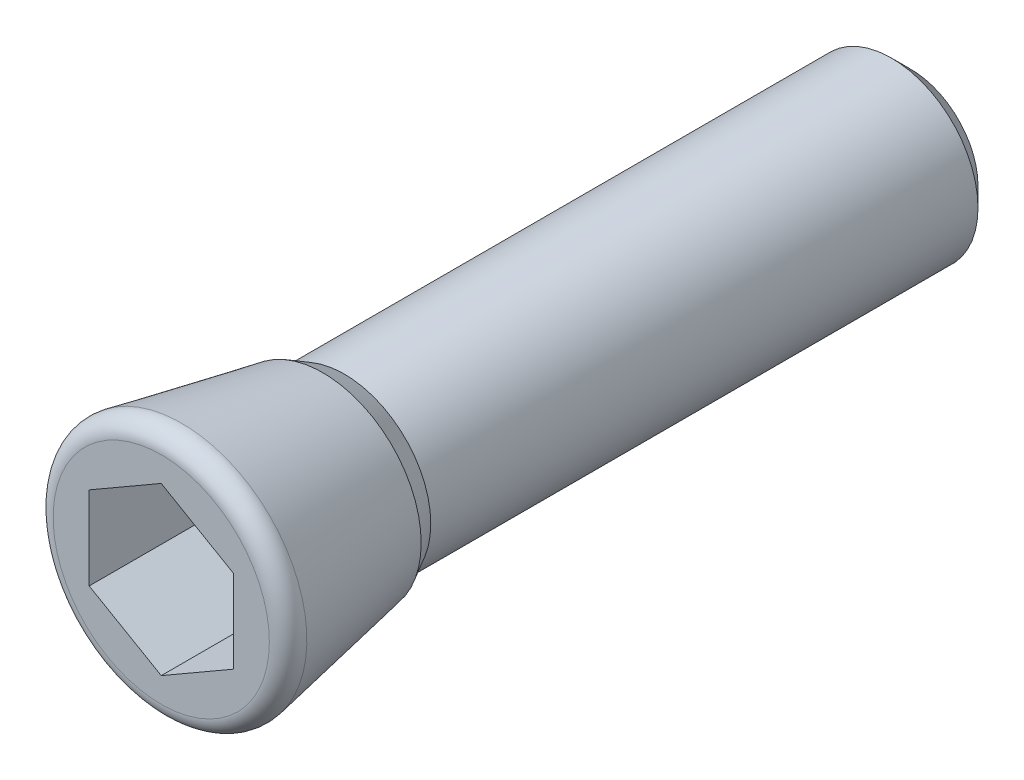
ISO-10303-21;
HEADER;
FILE_DESCRIPTION(('STEP AP214'),'2;1');
FILE_NAME('part.step','',(''),(''),'','','');
FILE_SCHEMA(('AUTOMOTIVE_DESIGN { 1 0 10303 214 1 1 1 1 }'));
ENDSEC;
DATA;
#1=APPLICATION_CONTEXT('core data for automotive mechanical design processes');
#2=APPLICATION_PROTOCOL_DEFINITION('international standard','automotive_design',2000,#1);
#3=PRODUCT_CONTEXT('',#1,'mechanical');
#4=PRODUCT('Part','Part','',(#3));
#5=PRODUCT_RELATED_PRODUCT_CATEGORY('part','',(#4));
#6=PRODUCT_DEFINITION_FORMATION('','',#4);
#7=PRODUCT_DEFINITION_CONTEXT('part definition',#1,'design');
#8=PRODUCT_DEFINITION('design','',#6,#7);
#9=PRODUCT_DEFINITION_SHAPE('','',#8);
#10=(LENGTH_UNIT() NAMED_UNIT(*) SI_UNIT(.MILLI.,.METRE.));
#11=(NAMED_UNIT(*) PLANE_ANGLE_UNIT() SI_UNIT($,.RADIAN.));
#12=(NAMED_UNIT(*) SI_UNIT($,.STERADIAN.) SOLID_ANGLE_UNIT());
#13=UNCERTAINTY_MEASURE_WITH_UNIT(LENGTH_MEASURE(1.E-05),#10,'distance_accuracy_value','');
#14=(GEOMETRIC_REPRESENTATION_CONTEXT(3) GLOBAL_UNCERTAINTY_ASSIGNED_CONTEXT((#13)) GLOBAL_UNIT_ASSIGNED_CONTEXT((#10,
#11,#12)) REPRESENTATION_CONTEXT('',''));
#15=CARTESIAN_POINT('',(0.,0.,0.));
#16=DIRECTION('',(0.,0.,1.));
#17=DIRECTION('',(1.,0.,0.));
#18=AXIS2_PLACEMENT_3D('',#15,#16,#17);
#19=CARTESIAN_POINT('',(-4.0419021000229,2.33359326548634,-52.));
#20=DIRECTION('',(0.,0.,-1.));
#21=DIRECTION('',(-0.5,-0.866025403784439,0.));
#22=AXIS2_PLACEMENT_3D('',#19,#20,#21);
#23=PLANE('',#22);
#24=CARTESIAN_POINT('',(0.,0.,-52.));
#25=DIRECTION('',(0.,0.,-1.));
#26=DIRECTION('',(-0.5,-0.866025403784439,0.));
#27=AXIS2_PLACEMENT_3D('',#24,#25,#26);
#28=CIRCLE('',#27,4.66718653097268);
#29=CARTESIAN_POINT('',(-2.33359326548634,-4.04190210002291,-52.));
#30=VERTEX_POINT('',#29);
#31=EDGE_CURVE('E9',#30,#30,#28,.T.);
#32=ORIENTED_EDGE('',*,*,#31,.T.);
#33=EDGE_LOOP('',(#32));
#34=FACE_BOUND('',#33,.T.);
#35=ADVANCED_FACE('F14',(#34),#23,.T.);
#36=CARTESIAN_POINT('',(0.,0.,-52.));
#37=DIRECTION('',(0.,0.,1.));
#38=DIRECTION('',(0.5,0.866025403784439,0.));
#39=AXIS2_PLACEMENT_3D('',#36,#37,#38);
#40=CONICAL_SURFACE('',#39,4.66718653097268,0.785398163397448);
#41=CARTESIAN_POINT('',(0.,0.,-50.6671865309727));
#42=DIRECTION('',(0.,0.,-1.));
#43=DIRECTION('',(-0.5,-0.866025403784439,0.));
#44=AXIS2_PLACEMENT_3D('',#41,#42,#43);
#45=CIRCLE('',#44,6.);
#46=CARTESIAN_POINT('',(-3.,-5.19615242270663,-50.6671865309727));
#47=VERTEX_POINT('',#46);
#48=EDGE_CURVE('E21',#47,#47,#45,.T.);
#49=ORIENTED_EDGE('',*,*,#48,.T.);
#50=EDGE_LOOP('',(#49));
#51=FACE_BOUND('',#50,.T.);
#52=ORIENTED_EDGE('',*,*,#31,.F.);
#53=EDGE_LOOP('',(#52));
#54=FACE_BOUND('',#53,.T.);
#55=ADVANCED_FACE('F136',(#51,#54),#40,.T.);
#56=CARTESIAN_POINT('',(0.,0.,-72.0161004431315));
#57=DIRECTION('',(0.,0.,-1.));
#58=DIRECTION('',(-0.5,-0.866025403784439,0.));
#59=AXIS2_PLACEMENT_3D('',#56,#57,#58);
#60=CYLINDRICAL_SURFACE('',#59,6.);
#61=CARTESIAN_POINT('',(0.,0.,-12.7));
#62=DIRECTION('',(0.,0.,-1.));
#63=DIRECTION('',(-0.5,-0.866025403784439,0.));
#64=AXIS2_PLACEMENT_3D('',#61,#62,#63);
#65=CIRCLE('',#64,6.);
#66=CARTESIAN_POINT('',(-3.,-5.19615242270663,-12.7));
#67=VERTEX_POINT('',#66);
#68=EDGE_CURVE('E131',#67,#67,#65,.T.);
#69=ORIENTED_EDGE('',*,*,#68,.T.);
#70=EDGE_LOOP('',(#69));
#71=FACE_BOUND('',#70,.T.);
#72=ORIENTED_EDGE('',*,*,#48,.F.);
#73=EDGE_LOOP('',(#72));
#74=FACE_BOUND('',#73,.T.);
#75=ADVANCED_FACE('F139',(#71,#74),#60,.T.);
#76=CARTESIAN_POINT('',(0.,0.,-12.7));
#77=DIRECTION('',(0.,0.,1.));
#78=DIRECTION('',(0.5,0.866025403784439,0.));
#79=AXIS2_PLACEMENT_3D('',#76,#77,#78);
#80=CONICAL_SURFACE('',#79,6.,0.505024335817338);
#81=CARTESIAN_POINT('',(0.,0.,-11.2136100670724));
#82=DIRECTION('',(0.,0.,-1.));
#83=DIRECTION('',(-0.5,-0.866025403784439,0.));
#84=AXIS2_PLACEMENT_3D('',#81,#82,#83);
#85=CIRCLE('',#84,6.82174224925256);
#86=CARTESIAN_POINT('',(-3.41087112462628,-5.90780208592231,-11.2136100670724));
#87=VERTEX_POINT('',#86);
#88=EDGE_CURVE('E128',#87,#87,#85,.T.);
#89=ORIENTED_EDGE('',*,*,#88,.T.);
#90=EDGE_LOOP('',(#89));
#91=FACE_BOUND('',#90,.T.);
#92=ORIENTED_EDGE('',*,*,#68,.F.);
#93=EDGE_LOOP('',(#92));
#94=FACE_BOUND('',#93,.T.);
#95=ADVANCED_FACE('F141',(#91,#94),#80,.T.);
#96=CARTESIAN_POINT('',(0.,0.,-11.2136100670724));
#97=DIRECTION('',(0.,0.,1.));
#98=DIRECTION('',(0.5,0.866025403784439,0.));
#99=AXIS2_PLACEMENT_3D('',#96,#97,#98);
#100=CONICAL_SURFACE('',#99,6.82174224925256,0.187479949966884);
#101=CARTESIAN_POINT('',(0.,0.,-1.4236603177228));
#102=DIRECTION('',(0.,0.,-1.));
#103=DIRECTION('',(-0.5,-0.866025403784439,0.));
#104=AXIS2_PLACEMENT_3D('',#101,#102,#103);
#105=CIRCLE('',#104,8.67897246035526);
#106=CARTESIAN_POINT('',(-4.33948623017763,-7.51621062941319,-1.4236603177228));
#107=VERTEX_POINT('',#106);
#108=EDGE_CURVE('E125',#107,#107,#105,.T.);
#109=ORIENTED_EDGE('',*,*,#108,.T.);
#110=EDGE_LOOP('',(#109));
#111=FACE_BOUND('',#110,.T.);
#112=ORIENTED_EDGE('',*,*,#88,.F.);
#113=EDGE_LOOP('',(#112));
#114=FACE_BOUND('',#113,.T.);
#115=ADVANCED_FACE('F150',(#111,#114),#100,.T.);
#116=CARTESIAN_POINT('',(0.,0.,-1.2));
#117=DIRECTION('',(0.,0.,-1.));
#118=DIRECTION('',(-0.5,-0.866025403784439,0.));
#119=AXIS2_PLACEMENT_3D('',#116,#117,#118);
#120=TOROIDAL_SURFACE('',#119,7.5,1.2);
#121=CARTESIAN_POINT('',(0.,0.,0.));
#122=DIRECTION('',(0.,0.,-1.));
#123=DIRECTION('',(-0.5,-0.866025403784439,0.));
#124=AXIS2_PLACEMENT_3D('',#121,#122,#123);
#125=CIRCLE('',#124,7.5);
#126=CARTESIAN_POINT('',(-3.75,-6.49519052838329,0.));
#127=VERTEX_POINT('',#126);
#128=EDGE_CURVE('E116',#127,#127,#125,.T.);
#129=ORIENTED_EDGE('',*,*,#128,.T.);
#130=EDGE_LOOP('',(#129));
#131=FACE_BOUND('',#130,.T.);
#132=ORIENTED_EDGE('',*,*,#108,.F.);
#133=EDGE_LOOP('',(#132));
#134=FACE_BOUND('',#133,.T.);
#135=ADVANCED_FACE('F189',(#131,#134),#120,.T.);
#136=CARTESIAN_POINT('',(0.,0.,0.));
#137=DIRECTION('',(0.,0.,1.));
#138=DIRECTION('',(0.5,0.866025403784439,0.));
#139=AXIS2_PLACEMENT_3D('',#136,#137,#138);
#140=PLANE('',#139);
#141=DIRECTION('',(0.866025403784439,0.5,0.));
#142=VECTOR('',#141,1.);
#143=CARTESIAN_POINT('',(0.,-5.77350269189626,0.));
#144=LINE('',#143,#142);
#145=CARTESIAN_POINT('',(0.,-5.77350269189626,0.));
#146=VERTEX_POINT('',#145);
#147=CARTESIAN_POINT('',(5.,-2.88675134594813,0.));
#148=VERTEX_POINT('',#147);
#149=EDGE_CURVE('E28',#146,#148,#144,.T.);
#150=ORIENTED_EDGE('',*,*,#149,.F.);
#151=DIRECTION('',(0.866025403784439,-0.5,0.));
#152=VECTOR('',#151,1.);
#153=CARTESIAN_POINT('',(-5.,-2.88675134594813,0.));
#154=LINE('',#153,#152);
#155=CARTESIAN_POINT('',(-5.,-2.88675134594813,0.));
#156=VERTEX_POINT('',#155);
#157=EDGE_CURVE('E98',#156,#146,#154,.T.);
#158=ORIENTED_EDGE('',*,*,#157,.F.);
#159=DIRECTION('',(0.,-1.,0.));
#160=VECTOR('',#159,1.);
#161=CARTESIAN_POINT('',(-5.,2.88675134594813,0.));
#162=LINE('',#161,#160);
#163=CARTESIAN_POINT('',(-5.,2.88675134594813,0.));
#164=VERTEX_POINT('',#163);
#165=EDGE_CURVE('E92',#164,#156,#162,.T.);
#166=ORIENTED_EDGE('',*,*,#165,.F.);
#167=DIRECTION('',(-0.866025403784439,-0.5,0.));
#168=VECTOR('',#167,1.);
#169=CARTESIAN_POINT('',(0.,5.77350269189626,0.));
#170=LINE('',#169,#168);
#171=CARTESIAN_POINT('',(0.,5.77350269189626,0.));
#172=VERTEX_POINT('',#171);
#173=EDGE_CURVE('E90',#172,#164,#170,.T.);
#174=ORIENTED_EDGE('',*,*,#173,.F.);
#175=DIRECTION('',(-0.866025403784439,0.5,0.));
#176=VECTOR('',#175,1.);
#177=CARTESIAN_POINT('',(5.,2.88675134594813,0.));
#178=LINE('',#177,#176);
#179=CARTESIAN_POINT('',(5.,2.88675134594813,0.));
#180=VERTEX_POINT('',#179);
#181=EDGE_CURVE('E71',#180,#172,#178,.T.);
#182=ORIENTED_EDGE('',*,*,#181,.F.);
#183=DIRECTION('',(0.,1.,0.));
#184=VECTOR('',#183,1.);
#185=CARTESIAN_POINT('',(5.,-2.88675134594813,0.));
#186=LINE('',#185,#184);
#187=EDGE_CURVE('E82',#148,#180,#186,.T.);
#188=ORIENTED_EDGE('',*,*,#187,.F.);
#189=EDGE_LOOP('',(#150,#158,#166,#174,#182,#188));
#190=FACE_BOUND('',#189,.T.);
#191=ORIENTED_EDGE('',*,*,#128,.F.);
#192=EDGE_LOOP('',(#191));
#193=FACE_BOUND('',#192,.T.);
#194=ADVANCED_FACE('F86',(#190,#193),#140,.T.);
#195=CARTESIAN_POINT('',(0.,-5.77350269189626,-7.5));
#196=DIRECTION('',(0.5,-0.866025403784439,0.));
#197=DIRECTION('',(0.866025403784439,0.5,0.));
#198=AXIS2_PLACEMENT_3D('',#195,#196,#197);
#199=PLANE('',#198);
#200=ORIENTED_EDGE('',*,*,#149,.T.);
#201=DIRECTION('',(0.,0.,1.));
#202=VECTOR('',#201,1.);
#203=CARTESIAN_POINT('',(5.,-2.88675134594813,-7.5));
#204=LINE('',#203,#202);
#205=CARTESIAN_POINT('',(5.,-2.88675134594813,-7.5));
#206=VERTEX_POINT('',#205);
#207=EDGE_CURVE('E79',#206,#148,#204,.T.);
#208=ORIENTED_EDGE('',*,*,#207,.F.);
#209=DIRECTION('',(0.866025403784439,0.5,0.));
#210=VECTOR('',#209,1.);
#211=CARTESIAN_POINT('',(0.,-5.77350269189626,-7.5));
#212=LINE('',#211,#210);
#213=CARTESIAN_POINT('',(0.,-5.77350269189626,-7.5));
#214=VERTEX_POINT('',#213);
#215=EDGE_CURVE('E100',#214,#206,#212,.T.);
#216=ORIENTED_EDGE('',*,*,#215,.F.);
#217=DIRECTION('',(0.,0.,1.));
#218=VECTOR('',#217,1.);
#219=CARTESIAN_POINT('',(0.,-5.77350269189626,-7.5));
#220=LINE('',#219,#218);
#221=EDGE_CURVE('E35',#214,#146,#220,.T.);
#222=ORIENTED_EDGE('',*,*,#221,.T.);
#223=EDGE_LOOP('',(#200,#208,#216,#222));
#224=FACE_BOUND('',#223,.T.);
#225=ADVANCED_FACE('F205',(#224),#199,.F.);
#226=CARTESIAN_POINT('',(-5.,-2.88675134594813,-7.5));
#227=DIRECTION('',(-0.5,-0.866025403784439,0.));
#228=DIRECTION('',(0.866025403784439,-0.5,0.));
#229=AXIS2_PLACEMENT_3D('',#226,#227,#228);
#230=PLANE('',#229);
#231=ORIENTED_EDGE('',*,*,#157,.T.);
#232=ORIENTED_EDGE('',*,*,#221,.F.);
#233=DIRECTION('',(0.866025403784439,-0.5,0.));
#234=VECTOR('',#233,1.);
#235=CARTESIAN_POINT('',(-5.,-2.88675134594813,-7.5));
#236=LINE('',#235,#234);
#237=CARTESIAN_POINT('',(-5.,-2.88675134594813,-7.5));
#238=VERTEX_POINT('',#237);
#239=EDGE_CURVE('E112',#238,#214,#236,.T.);
#240=ORIENTED_EDGE('',*,*,#239,.F.);
#241=DIRECTION('',(0.,0.,1.));
#242=VECTOR('',#241,1.);
#243=CARTESIAN_POINT('',(-5.,-2.88675134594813,-7.5));
#244=LINE('',#243,#242);
#245=EDGE_CURVE('E117',#238,#156,#244,.T.);
#246=ORIENTED_EDGE('',*,*,#245,.T.);
#247=EDGE_LOOP('',(#231,#232,#240,#246));
#248=FACE_BOUND('',#247,.T.);
#249=ADVANCED_FACE('F213',(#248),#230,.F.);
#250=CARTESIAN_POINT('',(-5.,2.88675134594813,-7.5));
#251=DIRECTION('',(-1.,0.,0.));
#252=DIRECTION('',(0.,-1.,0.));
#253=AXIS2_PLACEMENT_3D('',#250,#251,#252);
#254=PLANE('',#253);
#255=ORIENTED_EDGE('',*,*,#165,.T.);
#256=ORIENTED_EDGE('',*,*,#245,.F.);
#257=DIRECTION('',(0.,-1.,0.));
#258=VECTOR('',#257,1.);
#259=CARTESIAN_POINT('',(-5.,2.88675134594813,-7.5));
#260=LINE('',#259,#258);
#261=CARTESIAN_POINT('',(-5.,2.88675134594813,-7.5));
#262=VERTEX_POINT('',#261);
#263=EDGE_CURVE('E109',#262,#238,#260,.T.);
#264=ORIENTED_EDGE('',*,*,#263,.F.);
#265=DIRECTION('',(0.,0.,1.));
#266=VECTOR('',#265,1.);
#267=CARTESIAN_POINT('',(-5.,2.88675134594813,-7.5));
#268=LINE('',#267,#266);
#269=EDGE_CURVE('E119',#262,#164,#268,.T.);
#270=ORIENTED_EDGE('',*,*,#269,.T.);
#271=EDGE_LOOP('',(#255,#256,#264,#270));
#272=FACE_BOUND('',#271,.T.);
#273=ADVANCED_FACE('F221',(#272),#254,.F.);
#274=CARTESIAN_POINT('',(0.,5.77350269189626,-7.5));
#275=DIRECTION('',(-0.5,0.866025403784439,0.));
#276=DIRECTION('',(-0.866025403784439,-0.5,0.));
#277=AXIS2_PLACEMENT_3D('',#274,#275,#276);
#278=PLANE('',#277);
#279=ORIENTED_EDGE('',*,*,#173,.T.);
#280=ORIENTED_EDGE('',*,*,#269,.F.);
#281=DIRECTION('',(-0.866025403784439,-0.5,0.));
#282=VECTOR('',#281,1.);
#283=CARTESIAN_POINT('',(0.,5.77350269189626,-7.5));
#284=LINE('',#283,#282);
#285=CARTESIAN_POINT('',(0.,5.77350269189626,-7.5));
#286=VERTEX_POINT('',#285);
#287=EDGE_CURVE('E106',#286,#262,#284,.T.);
#288=ORIENTED_EDGE('',*,*,#287,.F.);
#289=DIRECTION('',(0.,0.,1.));
#290=VECTOR('',#289,1.);
#291=CARTESIAN_POINT('',(0.,5.77350269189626,-7.5));
#292=LINE('',#291,#290);
#293=EDGE_CURVE('E78',#286,#172,#292,.T.);
#294=ORIENTED_EDGE('',*,*,#293,.T.);
#295=EDGE_LOOP('',(#279,#280,#288,#294));
#296=FACE_BOUND('',#295,.T.);
#297=ADVANCED_FACE('F229',(#296),#278,.F.);
#298=CARTESIAN_POINT('',(5.,2.88675134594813,-7.5));
#299=DIRECTION('',(0.5,0.866025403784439,0.));
#300=DIRECTION('',(-0.866025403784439,0.5,0.));
#301=AXIS2_PLACEMENT_3D('',#298,#299,#300);
#302=PLANE('',#301);
#303=ORIENTED_EDGE('',*,*,#181,.T.);
#304=ORIENTED_EDGE('',*,*,#293,.F.);
#305=DIRECTION('',(-0.866025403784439,0.5,0.));
#306=VECTOR('',#305,1.);
#307=CARTESIAN_POINT('',(5.,2.88675134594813,-7.5));
#308=LINE('',#307,#306);
#309=CARTESIAN_POINT('',(5.,2.88675134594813,-7.5));
#310=VERTEX_POINT('',#309);
#311=EDGE_CURVE('E74',#310,#286,#308,.T.);
#312=ORIENTED_EDGE('',*,*,#311,.F.);
#313=DIRECTION('',(0.,0.,1.));
#314=VECTOR('',#313,1.);
#315=CARTESIAN_POINT('',(5.,2.88675134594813,-7.5));
#316=LINE('',#315,#314);
#317=EDGE_CURVE('E67',#310,#180,#316,.T.);
#318=ORIENTED_EDGE('',*,*,#317,.T.);
#319=EDGE_LOOP('',(#303,#304,#312,#318));
#320=FACE_BOUND('',#319,.T.);
#321=ADVANCED_FACE('F69',(#320),#302,.F.);
#322=CARTESIAN_POINT('',(5.,-2.88675134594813,-7.5));
#323=DIRECTION('',(1.,0.,0.));
#324=DIRECTION('',(0.,1.,0.));
#325=AXIS2_PLACEMENT_3D('',#322,#323,#324);
#326=PLANE('',#325);
#327=ORIENTED_EDGE('',*,*,#187,.T.);
#328=ORIENTED_EDGE('',*,*,#317,.F.);
#329=DIRECTION('',(0.,1.,0.));
#330=VECTOR('',#329,1.);
#331=CARTESIAN_POINT('',(5.,-2.88675134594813,-7.5));
#332=LINE('',#331,#330);
#333=EDGE_CURVE('E103',#206,#310,#332,.T.);
#334=ORIENTED_EDGE('',*,*,#333,.F.);
#335=ORIENTED_EDGE('',*,*,#207,.T.);
#336=EDGE_LOOP('',(#327,#328,#334,#335));
#337=FACE_BOUND('',#336,.T.);
#338=ADVANCED_FACE('F83',(#337),#326,.F.);
#339=CARTESIAN_POINT('',(0.,-5.77350269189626,-7.5));
#340=DIRECTION('',(0.,0.,-1.));
#341=DIRECTION('',(-0.5,-0.866025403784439,0.));
#342=AXIS2_PLACEMENT_3D('',#339,#340,#341);
#343=PLANE('',#342);
#344=ORIENTED_EDGE('',*,*,#215,.T.);
#345=ORIENTED_EDGE('',*,*,#333,.T.);
#346=ORIENTED_EDGE('',*,*,#311,.T.);
#347=ORIENTED_EDGE('',*,*,#287,.T.);
#348=ORIENTED_EDGE('',*,*,#263,.T.);
#349=ORIENTED_EDGE('',*,*,#239,.T.);
#350=EDGE_LOOP('',(#344,#345,#346,#347,#348,#349));
#351=FACE_BOUND('',#350,.T.);
#352=ADVANCED_FACE('F253',(#351),#343,.F.);
#353=CLOSED_SHELL('',(#35,#55,#75,#95,#115,#135,#194,#225,#249,#273,#297,#321,#338,#352));
#354=MANIFOLD_SOLID_BREP('B1',#353);
#355=ADVANCED_BREP_SHAPE_REPRESENTATION('',(#18,#354),#14);
#356=SHAPE_DEFINITION_REPRESENTATION(#9,#355);
ENDSEC;
END-ISO-10303-21;
